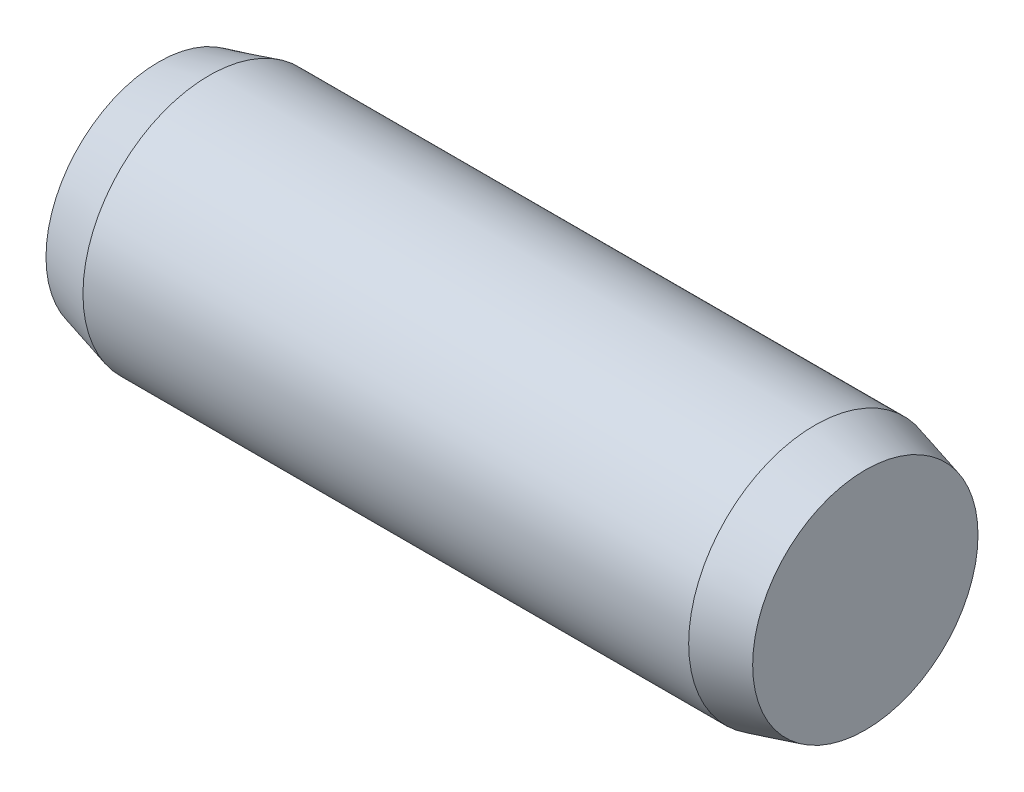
from build123d import *


with BuildPart() as part:
    # Sketch1 → Base-Revolve (revolve)
    with BuildSketch(Plane.XY, mode=Mode.PRIVATE) as base_revolve_sk:
        Polygon((0, 0), (28, 0), (28, 4.464101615), (26, 5), (2, 5), (0, 4.464101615), align=None)
    revolve(base_revolve_sk.sketch.rotate(Axis((-6.35, 0, 0), (1, 0, 0)), 90), axis=Axis((-6.35, 0, 0), (1, 0, 0)))


solid = part.part
